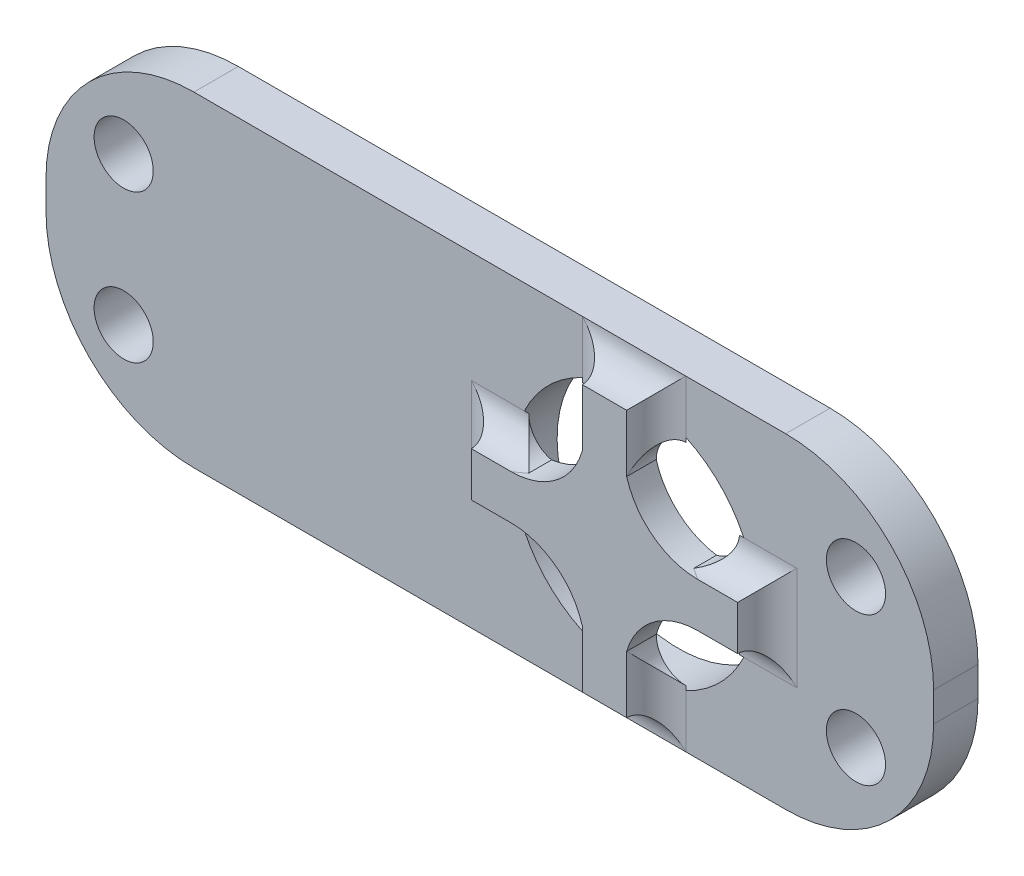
ISO-10303-21;
HEADER;
FILE_DESCRIPTION(('STEP AP214'),'2;1');
FILE_NAME('part.step','',(''),(''),'','','');
FILE_SCHEMA(('AUTOMOTIVE_DESIGN { 1 0 10303 214 1 1 1 1 }'));
ENDSEC;
DATA;
#1=APPLICATION_CONTEXT('core data for automotive mechanical design processes');
#2=APPLICATION_PROTOCOL_DEFINITION('international standard','automotive_design',2000,#1);
#3=PRODUCT_CONTEXT('',#1,'mechanical');
#4=PRODUCT('Part','Part','',(#3));
#5=PRODUCT_RELATED_PRODUCT_CATEGORY('part','',(#4));
#6=PRODUCT_DEFINITION_FORMATION('','',#4);
#7=PRODUCT_DEFINITION_CONTEXT('part definition',#1,'design');
#8=PRODUCT_DEFINITION('design','',#6,#7);
#9=PRODUCT_DEFINITION_SHAPE('','',#8);
#10=(LENGTH_UNIT() NAMED_UNIT(*) SI_UNIT(.MILLI.,.METRE.));
#11=(NAMED_UNIT(*) PLANE_ANGLE_UNIT() SI_UNIT($,.RADIAN.));
#12=(NAMED_UNIT(*) SI_UNIT($,.STERADIAN.) SOLID_ANGLE_UNIT());
#13=UNCERTAINTY_MEASURE_WITH_UNIT(LENGTH_MEASURE(1.E-05),#10,'distance_accuracy_value','');
#14=(GEOMETRIC_REPRESENTATION_CONTEXT(3) GLOBAL_UNCERTAINTY_ASSIGNED_CONTEXT((#13)) GLOBAL_UNIT_ASSIGNED_CONTEXT((#10,
#11,#12)) REPRESENTATION_CONTEXT('',''));
#15=CARTESIAN_POINT('',(0.,0.,0.));
#16=DIRECTION('',(0.,0.,1.));
#17=DIRECTION('',(1.,0.,0.));
#18=AXIS2_PLACEMENT_3D('',#15,#16,#17);
#19=CARTESIAN_POINT('',(13.2499999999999,35.1176166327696,3.));
#20=DIRECTION('',(0.,0.,-1.));
#21=DIRECTION('',(-1.,0.,0.));
#22=AXIS2_PLACEMENT_3D('',#19,#20,#21);
#23=CYLINDRICAL_SURFACE('',#22,2.);
#24=CARTESIAN_POINT('',(13.2499999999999,35.1176166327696,3.));
#25=DIRECTION('',(0.,0.,-1.));
#26=DIRECTION('',(-1.,0.,0.));
#27=AXIS2_PLACEMENT_3D('',#24,#25,#26);
#28=CIRCLE('',#27,2.);
#29=CARTESIAN_POINT('',(13.2499999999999,37.1176166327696,3.));
#30=VERTEX_POINT('',#29);
#31=CARTESIAN_POINT('',(11.2499999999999,35.1176166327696,3.));
#32=VERTEX_POINT('',#31);
#33=EDGE_CURVE('E510',#30,#32,#28,.F.);
#34=ORIENTED_EDGE('',*,*,#33,.F.);
#35=CARTESIAN_POINT('',(13.2499999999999,35.1176166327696,5.));
#36=DIRECTION('',(0.,-0.707106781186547,-0.707106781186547));
#37=DIRECTION('',(0.,-0.707106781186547,0.707106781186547));
#38=AXIS2_PLACEMENT_3D('',#35,#36,#37);
#39=ELLIPSE('',#38,2.82842712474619,2.);
#40=CARTESIAN_POINT('',(11.2499999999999,35.1176166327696,5.));
#41=VERTEX_POINT('',#40);
#42=EDGE_CURVE('E507',#41,#30,#39,.T.);
#43=ORIENTED_EDGE('',*,*,#42,.F.);
#44=DIRECTION('',(0.,0.,-1.));
#45=VECTOR('',#44,1.);
#46=CARTESIAN_POINT('',(11.2499999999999,35.1176166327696,5.));
#47=LINE('',#46,#45);
#48=EDGE_CURVE('E500',#32,#41,#47,.F.);
#49=ORIENTED_EDGE('',*,*,#48,.F.);
#50=EDGE_LOOP('',(#34,#43,#49));
#51=FACE_BOUND('',#50,.T.);
#52=ADVANCED_FACE('F37',(#51),#23,.F.);
#53=CARTESIAN_POINT('',(0.,0.,3.));
#54=DIRECTION('',(0.,0.,-1.));
#55=DIRECTION('',(-1.,0.,0.));
#56=AXIS2_PLACEMENT_3D('',#53,#54,#55);
#57=PLANE('',#56);
#58=DIRECTION('',(0.,1.,0.));
#59=VECTOR('',#58,1.);
#60=CARTESIAN_POINT('',(13.2499999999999,38.061637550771,3.));
#61=LINE('',#60,#59);
#62=CARTESIAN_POINT('',(13.2499999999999,37.415524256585,3.));
#63=VERTEX_POINT('',#62);
#64=EDGE_CURVE('E470',#63,#30,#61,.F.);
#65=ORIENTED_EDGE('',*,*,#64,.T.);
#66=ORIENTED_EDGE('',*,*,#33,.T.);
#67=CARTESIAN_POINT('',(16.0551031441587,36.5,3.));
#68=DIRECTION('',(0.,0.,-1.));
#69=DIRECTION('',(-1.,0.,0.));
#70=AXIS2_PLACEMENT_3D('',#67,#68,#69);
#71=CIRCLE('',#70,5.);
#72=CARTESIAN_POINT('',(15.326541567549,31.5533649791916,3.));
#73=VERTEX_POINT('',#72);
#74=EDGE_CURVE('E673',#32,#73,#71,.F.);
#75=ORIENTED_EDGE('',*,*,#74,.T.);
#76=CARTESIAN_POINT('',(14.8676166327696,33.5,3.));
#77=DIRECTION('',(0.,0.,-1.));
#78=DIRECTION('',(-1.,0.,0.));
#79=AXIS2_PLACEMENT_3D('',#76,#77,#78);
#80=CIRCLE('',#79,2.);
#81=CARTESIAN_POINT('',(16.8676166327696,33.5,3.));
#82=VERTEX_POINT('',#81);
#83=EDGE_CURVE('E451',#73,#82,#80,.F.);
#84=ORIENTED_EDGE('',*,*,#83,.T.);
#85=DIRECTION('',(-1.,0.,0.));
#86=VECTOR('',#85,1.);
#87=CARTESIAN_POINT('',(18.75,33.5,3.));
#88=LINE('',#87,#86);
#89=CARTESIAN_POINT('',(17.165524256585,33.5,3.));
#90=VERTEX_POINT('',#89);
#91=EDGE_CURVE('E417',#82,#90,#88,.F.);
#92=ORIENTED_EDGE('',*,*,#91,.T.);
#93=CARTESIAN_POINT('',(9.74999999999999,30.,3.));
#94=DIRECTION('',(0.,0.,1.));
#95=DIRECTION('',(1.,0.,0.));
#96=AXIS2_PLACEMENT_3D('',#93,#94,#95);
#97=CIRCLE('',#96,8.2);
#98=CARTESIAN_POINT('',(17.165524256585,26.5,3.));
#99=VERTEX_POINT('',#98);
#100=EDGE_CURVE('E339',#99,#90,#97,.T.);
#101=ORIENTED_EDGE('',*,*,#100,.F.);
#102=DIRECTION('',(1.,0.,0.));
#103=VECTOR('',#102,1.);
#104=CARTESIAN_POINT('',(17.8116375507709,26.5,3.));
#105=LINE('',#104,#103);
#106=CARTESIAN_POINT('',(16.8676166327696,26.5,3.));
#107=VERTEX_POINT('',#106);
#108=EDGE_CURVE('E412',#99,#107,#105,.F.);
#109=ORIENTED_EDGE('',*,*,#108,.T.);
#110=CARTESIAN_POINT('',(14.8676166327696,26.5,3.));
#111=DIRECTION('',(0.,0.,-1.));
#112=DIRECTION('',(-1.,0.,0.));
#113=AXIS2_PLACEMENT_3D('',#110,#111,#112);
#114=CIRCLE('',#113,2.);
#115=CARTESIAN_POINT('',(15.3265415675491,28.4466350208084,3.));
#116=VERTEX_POINT('',#115);
#117=EDGE_CURVE('E443',#107,#116,#114,.F.);
#118=ORIENTED_EDGE('',*,*,#117,.T.);
#119=CARTESIAN_POINT('',(16.0551031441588,23.5,3.));
#120=DIRECTION('',(0.,0.,-1.));
#121=DIRECTION('',(-1.,0.,0.));
#122=AXIS2_PLACEMENT_3D('',#119,#120,#121);
#123=CIRCLE('',#122,5.);
#124=CARTESIAN_POINT('',(11.25,24.8823833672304,3.));
#125=VERTEX_POINT('',#124);
#126=EDGE_CURVE('E681',#116,#125,#123,.F.);
#127=ORIENTED_EDGE('',*,*,#126,.T.);
#128=CARTESIAN_POINT('',(13.25,24.8823833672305,3.));
#129=DIRECTION('',(0.,0.,-1.));
#130=DIRECTION('',(-1.,0.,0.));
#131=AXIS2_PLACEMENT_3D('',#128,#129,#130);
#132=CIRCLE('',#131,2.);
#133=CARTESIAN_POINT('',(13.2500000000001,22.8823833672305,3.));
#134=VERTEX_POINT('',#133);
#135=EDGE_CURVE('E503',#125,#134,#132,.F.);
#136=ORIENTED_EDGE('',*,*,#135,.T.);
#137=DIRECTION('',(0.,1.,0.));
#138=VECTOR('',#137,1.);
#139=CARTESIAN_POINT('',(13.2500000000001,21.,3.));
#140=LINE('',#139,#138);
#141=CARTESIAN_POINT('',(13.2500000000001,22.5844757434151,3.));
#142=VERTEX_POINT('',#141);
#143=EDGE_CURVE('E468',#134,#142,#140,.F.);
#144=ORIENTED_EDGE('',*,*,#143,.T.);
#145=CARTESIAN_POINT('',(9.74999999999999,30.,3.));
#146=DIRECTION('',(0.,0.,-1.));
#147=DIRECTION('',(-1.,0.,0.));
#148=AXIS2_PLACEMENT_3D('',#145,#146,#147);
#149=CIRCLE('',#148,8.2);
#150=CARTESIAN_POINT('',(6.25000000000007,22.584475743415,3.));
#151=VERTEX_POINT('',#150);
#152=EDGE_CURVE('E296',#142,#151,#149,.T.);
#153=ORIENTED_EDGE('',*,*,#152,.T.);
#154=DIRECTION('',(0.,-1.,0.));
#155=VECTOR('',#154,1.);
#156=CARTESIAN_POINT('',(6.25000000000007,21.938362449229,3.));
#157=LINE('',#156,#155);
#158=CARTESIAN_POINT('',(6.25000000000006,22.8823833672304,3.));
#159=VERTEX_POINT('',#158);
#160=EDGE_CURVE('E463',#151,#159,#157,.F.);
#161=ORIENTED_EDGE('',*,*,#160,.T.);
#162=CARTESIAN_POINT('',(6.25000000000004,24.8823833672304,3.));
#163=DIRECTION('',(0.,0.,-1.));
#164=DIRECTION('',(-1.,0.,0.));
#165=AXIS2_PLACEMENT_3D('',#162,#163,#164);
#166=CIRCLE('',#165,2.);
#167=CARTESIAN_POINT('',(8.25000000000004,24.8823833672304,3.));
#168=VERTEX_POINT('',#167);
#169=EDGE_CURVE('E488',#159,#168,#166,.F.);
#170=ORIENTED_EDGE('',*,*,#169,.T.);
#171=CARTESIAN_POINT('',(3.44489685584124,23.5,3.));
#172=DIRECTION('',(0.,0.,-1.));
#173=DIRECTION('',(-1.,0.,0.));
#174=AXIS2_PLACEMENT_3D('',#171,#172,#173);
#175=CIRCLE('',#174,5.);
#176=CARTESIAN_POINT('',(4.17345843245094,28.4466350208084,3.));
#177=VERTEX_POINT('',#176);
#178=EDGE_CURVE('E679',#168,#177,#175,.F.);
#179=ORIENTED_EDGE('',*,*,#178,.T.);
#180=CARTESIAN_POINT('',(4.63238336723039,26.5,3.));
#181=DIRECTION('',(0.,0.,-1.));
#182=DIRECTION('',(-1.,0.,0.));
#183=AXIS2_PLACEMENT_3D('',#180,#181,#182);
#184=CIRCLE('',#183,2.);
#185=CARTESIAN_POINT('',(2.63238336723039,26.5,3.));
#186=VERTEX_POINT('',#185);
#187=EDGE_CURVE('E446',#177,#186,#184,.F.);
#188=ORIENTED_EDGE('',*,*,#187,.T.);
#189=DIRECTION('',(1.,0.,0.));
#190=VECTOR('',#189,1.);
#191=CARTESIAN_POINT('',(0.749999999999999,26.5,3.));
#192=LINE('',#191,#190);
#193=CARTESIAN_POINT('',(2.33447574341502,26.5,3.));
#194=VERTEX_POINT('',#193);
#195=EDGE_CURVE('E423',#186,#194,#192,.F.);
#196=ORIENTED_EDGE('',*,*,#195,.T.);
#197=CARTESIAN_POINT('',(2.33447574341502,33.5,3.));
#198=VERTEX_POINT('',#197);
#199=EDGE_CURVE('E344',#198,#194,#97,.T.);
#200=ORIENTED_EDGE('',*,*,#199,.F.);
#201=DIRECTION('',(-1.,0.,0.));
#202=VECTOR('',#201,1.);
#203=CARTESIAN_POINT('',(1.68836244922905,33.5,3.));
#204=LINE('',#203,#202);
#205=CARTESIAN_POINT('',(2.63238336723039,33.5,3.));
#206=VERTEX_POINT('',#205);
#207=EDGE_CURVE('E426',#198,#206,#204,.F.);
#208=ORIENTED_EDGE('',*,*,#207,.T.);
#209=CARTESIAN_POINT('',(4.63238336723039,33.5,3.));
#210=DIRECTION('',(0.,0.,-1.));
#211=DIRECTION('',(-1.,0.,0.));
#212=AXIS2_PLACEMENT_3D('',#209,#210,#211);
#213=CIRCLE('',#212,2.);
#214=CARTESIAN_POINT('',(4.17345843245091,31.5533649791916,3.));
#215=VERTEX_POINT('',#214);
#216=EDGE_CURVE('E458',#206,#215,#213,.F.);
#217=ORIENTED_EDGE('',*,*,#216,.T.);
#218=CARTESIAN_POINT('',(3.44489685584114,36.5,3.));
#219=DIRECTION('',(0.,0.,-1.));
#220=DIRECTION('',(-1.,0.,0.));
#221=AXIS2_PLACEMENT_3D('',#218,#219,#220);
#222=CIRCLE('',#221,5.);
#223=CARTESIAN_POINT('',(8.24999999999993,35.1176166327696,3.));
#224=VERTEX_POINT('',#223);
#225=EDGE_CURVE('E11',#215,#224,#222,.F.);
#226=ORIENTED_EDGE('',*,*,#225,.T.);
#227=CARTESIAN_POINT('',(6.24999999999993,35.1176166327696,3.));
#228=DIRECTION('',(0.,0.,-1.));
#229=DIRECTION('',(-1.,0.,0.));
#230=AXIS2_PLACEMENT_3D('',#227,#228,#229);
#231=CIRCLE('',#230,2.);
#232=CARTESIAN_POINT('',(6.24999999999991,37.1176166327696,3.));
#233=VERTEX_POINT('',#232);
#234=EDGE_CURVE('E491',#224,#233,#231,.F.);
#235=ORIENTED_EDGE('',*,*,#234,.T.);
#236=DIRECTION('',(0.,-1.,0.));
#237=VECTOR('',#236,1.);
#238=CARTESIAN_POINT('',(6.24999999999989,39.,3.));
#239=LINE('',#238,#237);
#240=CARTESIAN_POINT('',(6.24999999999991,37.4155242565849,3.));
#241=VERTEX_POINT('',#240);
#242=EDGE_CURVE('E461',#233,#241,#239,.F.);
#243=ORIENTED_EDGE('',*,*,#242,.T.);
#244=EDGE_CURVE('E300',#241,#63,#149,.T.);
#245=ORIENTED_EDGE('',*,*,#244,.T.);
#246=EDGE_LOOP('',(#65,#66,#75,#84,#92,#101,#109,#118,#127,#136,#144,#153,#161,#170,#179,#188,
#196,#200,#208,#217,#226,#235,#243,#245));
#247=FACE_BOUND('',#246,.T.);
#248=ADVANCED_FACE('F646',(#247),#57,.T.);
#249=CARTESIAN_POINT('',(20.,31.,3.));
#250=DIRECTION('',(0.,0.,-1.));
#251=DIRECTION('',(-1.,0.,0.));
#252=AXIS2_PLACEMENT_3D('',#249,#250,#251);
#253=PLANE('',#252);
#254=CARTESIAN_POINT('',(24.75,35.,3.));
#255=DIRECTION('',(0.,0.,1.));
#256=DIRECTION('',(1.,0.,0.));
#257=AXIS2_PLACEMENT_3D('',#254,#255,#256);
#258=CIRCLE('',#257,2.);
#259=CARTESIAN_POINT('',(26.75,35.,3.));
#260=VERTEX_POINT('',#259);
#261=EDGE_CURVE('E327',#260,#260,#258,.T.);
#262=ORIENTED_EDGE('',*,*,#261,.F.);
#263=EDGE_LOOP('',(#262));
#264=FACE_BOUND('',#263,.T.);
#265=CARTESIAN_POINT('',(24.75,25.,3.));
#266=DIRECTION('',(0.,0.,1.));
#267=DIRECTION('',(1.,0.,0.));
#268=AXIS2_PLACEMENT_3D('',#265,#266,#267);
#269=CIRCLE('',#268,2.);
#270=CARTESIAN_POINT('',(26.75,25.,3.));
#271=VERTEX_POINT('',#270);
#272=EDGE_CURVE('E333',#271,#271,#269,.T.);
#273=ORIENTED_EDGE('',*,*,#272,.F.);
#274=EDGE_LOOP('',(#273));
#275=FACE_BOUND('',#274,.T.);
#276=CARTESIAN_POINT('',(13.2499999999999,41.,3.));
#277=VERTEX_POINT('',#276);
#278=EDGE_CURVE('E471',#277,#63,#61,.F.);
#279=ORIENTED_EDGE('',*,*,#278,.T.);
#280=EDGE_CURVE('E343',#90,#63,#97,.T.);
#281=ORIENTED_EDGE('',*,*,#280,.F.);
#282=CARTESIAN_POINT('',(20.75,33.5,3.));
#283=VERTEX_POINT('',#282);
#284=EDGE_CURVE('E416',#90,#283,#88,.F.);
#285=ORIENTED_EDGE('',*,*,#284,.T.);
#286=DIRECTION('',(0.,1.,0.));
#287=VECTOR('',#286,1.);
#288=CARTESIAN_POINT('',(20.75,28.5,3.));
#289=LINE('',#288,#287);
#290=CARTESIAN_POINT('',(20.75,26.5,3.));
#291=VERTEX_POINT('',#290);
#292=EDGE_CURVE('E410',#283,#291,#289,.F.);
#293=ORIENTED_EDGE('',*,*,#292,.T.);
#294=EDGE_CURVE('E413',#291,#99,#105,.F.);
#295=ORIENTED_EDGE('',*,*,#294,.T.);
#296=EDGE_CURVE('E297',#99,#142,#149,.T.);
#297=ORIENTED_EDGE('',*,*,#296,.T.);
#298=CARTESIAN_POINT('',(13.2500000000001,19.,3.));
#299=VERTEX_POINT('',#298);
#300=EDGE_CURVE('E467',#142,#299,#140,.F.);
#301=ORIENTED_EDGE('',*,*,#300,.T.);
#302=DIRECTION('',(1.,0.,0.));
#303=VECTOR('',#302,1.);
#304=CARTESIAN_POINT('',(-19.9999999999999,19.,3.));
#305=LINE('',#304,#303);
#306=CARTESIAN_POINT('',(19.9999999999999,19.,3.));
#307=VERTEX_POINT('',#306);
#308=EDGE_CURVE('E363',#299,#307,#305,.T.);
#309=ORIENTED_EDGE('',*,*,#308,.T.);
#310=CARTESIAN_POINT('',(20.,29.,3.));
#311=DIRECTION('',(0.,0.,1.));
#312=DIRECTION('',(1.,0.,0.));
#313=AXIS2_PLACEMENT_3D('',#310,#311,#312);
#314=CIRCLE('',#313,10.);
#315=CARTESIAN_POINT('',(30.,29.,3.));
#316=VERTEX_POINT('',#315);
#317=EDGE_CURVE('E367',#307,#316,#314,.T.);
#318=ORIENTED_EDGE('',*,*,#317,.T.);
#319=DIRECTION('',(0.,1.,0.));
#320=VECTOR('',#319,1.);
#321=CARTESIAN_POINT('',(30.,30.9999999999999,3.));
#322=LINE('',#321,#320);
#323=CARTESIAN_POINT('',(30.,30.9999999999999,3.));
#324=VERTEX_POINT('',#323);
#325=EDGE_CURVE('E369',#316,#324,#322,.T.);
#326=ORIENTED_EDGE('',*,*,#325,.T.);
#327=CARTESIAN_POINT('',(20.,31.,3.));
#328=DIRECTION('',(0.,0.,1.));
#329=DIRECTION('',(-1.,0.,0.));
#330=AXIS2_PLACEMENT_3D('',#327,#328,#329);
#331=CIRCLE('',#330,10.);
#332=CARTESIAN_POINT('',(19.9999999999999,41.,3.));
#333=VERTEX_POINT('',#332);
#334=EDGE_CURVE('E348',#324,#333,#331,.T.);
#335=ORIENTED_EDGE('',*,*,#334,.T.);
#336=DIRECTION('',(-1.,0.,0.));
#337=VECTOR('',#336,1.);
#338=CARTESIAN_POINT('',(-19.9999999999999,41.,3.));
#339=LINE('',#338,#337);
#340=EDGE_CURVE('E353',#333,#277,#339,.T.);
#341=ORIENTED_EDGE('',*,*,#340,.T.);
#342=EDGE_LOOP('',(#279,#281,#285,#293,#295,#297,#301,#309,#318,#326,#335,#341));
#343=FACE_BOUND('',#342,.T.);
#344=ADVANCED_FACE('F626',(#264,#275,#343),#253,.F.);
#345=CARTESIAN_POINT('',(6.25000000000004,24.8823833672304,3.));
#346=DIRECTION('',(0.,0.,-1.));
#347=DIRECTION('',(-1.,0.,0.));
#348=AXIS2_PLACEMENT_3D('',#345,#346,#347);
#349=CYLINDRICAL_SURFACE('',#348,2.);
#350=ORIENTED_EDGE('',*,*,#169,.F.);
#351=CARTESIAN_POINT('',(6.25000000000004,24.8823833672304,5.));
#352=DIRECTION('',(0.,0.707106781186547,-0.707106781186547));
#353=DIRECTION('',(0.,0.707106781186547,0.707106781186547));
#354=AXIS2_PLACEMENT_3D('',#351,#352,#353);
#355=ELLIPSE('',#354,2.82842712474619,2.);
#356=CARTESIAN_POINT('',(8.25000000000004,24.8823833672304,5.));
#357=VERTEX_POINT('',#356);
#358=EDGE_CURVE('E485',#357,#159,#355,.T.);
#359=ORIENTED_EDGE('',*,*,#358,.F.);
#360=DIRECTION('',(0.,0.,-1.));
#361=VECTOR('',#360,1.);
#362=CARTESIAN_POINT('',(8.25000000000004,24.8823833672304,5.));
#363=LINE('',#362,#361);
#364=EDGE_CURVE('E474',#168,#357,#363,.F.);
#365=ORIENTED_EDGE('',*,*,#364,.F.);
#366=EDGE_LOOP('',(#350,#359,#365));
#367=FACE_BOUND('',#366,.T.);
#368=ADVANCED_FACE('F624',(#367),#349,.F.);
#369=CARTESIAN_POINT('',(-24.75,25.,3.));
#370=DIRECTION('',(0.,0.,1.));
#371=DIRECTION('',(1.,0.,0.));
#372=AXIS2_PLACEMENT_3D('',#369,#370,#371);
#373=CIRCLE('',#372,2.);
#374=CARTESIAN_POINT('',(-22.75,25.,3.));
#375=VERTEX_POINT('',#374);
#376=EDGE_CURVE('E321',#375,#375,#373,.T.);
#377=ORIENTED_EDGE('',*,*,#376,.F.);
#378=EDGE_LOOP('',(#377));
#379=FACE_BOUND('',#378,.T.);
#380=CARTESIAN_POINT('',(-24.75,35.,3.));
#381=DIRECTION('',(0.,0.,1.));
#382=DIRECTION('',(1.,0.,0.));
#383=AXIS2_PLACEMENT_3D('',#380,#381,#382);
#384=CIRCLE('',#383,2.);
#385=CARTESIAN_POINT('',(-22.75,35.,3.));
#386=VERTEX_POINT('',#385);
#387=EDGE_CURVE('E315',#386,#386,#384,.T.);
#388=ORIENTED_EDGE('',*,*,#387,.F.);
#389=EDGE_LOOP('',(#388));
#390=FACE_BOUND('',#389,.T.);
#391=CARTESIAN_POINT('',(-1.25,33.5,3.));
#392=VERTEX_POINT('',#391);
#393=EDGE_CURVE('E427',#392,#198,#204,.F.);
#394=ORIENTED_EDGE('',*,*,#393,.T.);
#395=EDGE_CURVE('E301',#198,#241,#149,.T.);
#396=ORIENTED_EDGE('',*,*,#395,.T.);
#397=CARTESIAN_POINT('',(6.24999999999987,41.,3.));
#398=VERTEX_POINT('',#397);
#399=EDGE_CURVE('E460',#241,#398,#239,.F.);
#400=ORIENTED_EDGE('',*,*,#399,.T.);
#401=CARTESIAN_POINT('',(-19.9999999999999,41.,3.));
#402=VERTEX_POINT('',#401);
#403=EDGE_CURVE('E351',#398,#402,#339,.T.);
#404=ORIENTED_EDGE('',*,*,#403,.T.);
#405=CARTESIAN_POINT('',(-20.,31.,3.));
#406=DIRECTION('',(0.,0.,1.));
#407=DIRECTION('',(1.,0.,0.));
#408=AXIS2_PLACEMENT_3D('',#405,#406,#407);
#409=CIRCLE('',#408,10.);
#410=CARTESIAN_POINT('',(-30.,30.9999999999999,3.));
#411=VERTEX_POINT('',#410);
#412=EDGE_CURVE('E356',#402,#411,#409,.T.);
#413=ORIENTED_EDGE('',*,*,#412,.T.);
#414=DIRECTION('',(0.,-1.,0.));
#415=VECTOR('',#414,1.);
#416=CARTESIAN_POINT('',(-30.,30.9999999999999,3.));
#417=LINE('',#416,#415);
#418=CARTESIAN_POINT('',(-30.,29.0000000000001,3.));
#419=VERTEX_POINT('',#418);
#420=EDGE_CURVE('E359',#411,#419,#417,.T.);
#421=ORIENTED_EDGE('',*,*,#420,.T.);
#422=CARTESIAN_POINT('',(-20.,29.,3.));
#423=DIRECTION('',(0.,0.,1.));
#424=DIRECTION('',(1.,0.,0.));
#425=AXIS2_PLACEMENT_3D('',#422,#423,#424);
#426=CIRCLE('',#425,10.);
#427=CARTESIAN_POINT('',(-19.9999999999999,19.,3.));
#428=VERTEX_POINT('',#427);
#429=EDGE_CURVE('E361',#419,#428,#426,.T.);
#430=ORIENTED_EDGE('',*,*,#429,.T.);
#431=CARTESIAN_POINT('',(6.2500000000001,19.,3.));
#432=VERTEX_POINT('',#431);
#433=EDGE_CURVE('E364',#428,#432,#305,.T.);
#434=ORIENTED_EDGE('',*,*,#433,.T.);
#435=EDGE_CURVE('E464',#432,#151,#157,.F.);
#436=ORIENTED_EDGE('',*,*,#435,.T.);
#437=EDGE_CURVE('E347',#194,#151,#97,.T.);
#438=ORIENTED_EDGE('',*,*,#437,.F.);
#439=CARTESIAN_POINT('',(-1.25,26.5,3.));
#440=VERTEX_POINT('',#439);
#441=EDGE_CURVE('E422',#194,#440,#192,.F.);
#442=ORIENTED_EDGE('',*,*,#441,.T.);
#443=DIRECTION('',(0.,-1.,0.));
#444=VECTOR('',#443,1.);
#445=CARTESIAN_POINT('',(-1.25,31.5,3.));
#446=LINE('',#445,#444);
#447=EDGE_CURVE('E420',#440,#392,#446,.F.);
#448=ORIENTED_EDGE('',*,*,#447,.T.);
#449=EDGE_LOOP('',(#394,#396,#400,#404,#413,#421,#430,#434,#436,#438,#442,#448));
#450=FACE_BOUND('',#449,.T.);
#451=ADVANCED_FACE('F620',(#379,#390,#450),#253,.F.);
#452=CARTESIAN_POINT('',(4.63238336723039,33.5,3.));
#453=DIRECTION('',(0.,0.,-1.));
#454=DIRECTION('',(-1.,0.,0.));
#455=AXIS2_PLACEMENT_3D('',#452,#453,#454);
#456=CYLINDRICAL_SURFACE('',#455,2.);
#457=CARTESIAN_POINT('',(4.63238336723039,33.5,5.));
#458=DIRECTION('',(0.707106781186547,0.,-0.707106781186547));
#459=DIRECTION('',(0.707106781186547,0.,0.707106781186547));
#460=AXIS2_PLACEMENT_3D('',#457,#458,#459);
#461=ELLIPSE('',#460,2.82842712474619,2.);
#462=CARTESIAN_POINT('',(4.17345843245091,31.5533649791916,4.54107506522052));
#463=VERTEX_POINT('',#462);
#464=EDGE_CURVE('E456',#463,#206,#461,.T.);
#465=ORIENTED_EDGE('',*,*,#464,.F.);
#466=DIRECTION('',(0.,0.,-1.));
#467=VECTOR('',#466,1.);
#468=CARTESIAN_POINT('',(4.17345843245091,31.5533649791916,3.77053753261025));
#469=LINE('',#468,#467);
#470=EDGE_CURVE('E53',#463,#215,#469,.T.);
#471=ORIENTED_EDGE('',*,*,#470,.T.);
#472=ORIENTED_EDGE('',*,*,#216,.F.);
#473=EDGE_LOOP('',(#465,#471,#472));
#474=FACE_BOUND('',#473,.T.);
#475=ADVANCED_FACE('F623',(#474),#456,.F.);
#476=CARTESIAN_POINT('',(14.8676166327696,26.5,3.));
#477=DIRECTION('',(0.,0.,-1.));
#478=DIRECTION('',(-1.,0.,0.));
#479=AXIS2_PLACEMENT_3D('',#476,#477,#478);
#480=CYLINDRICAL_SURFACE('',#479,2.);
#481=CARTESIAN_POINT('',(14.8676166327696,26.5,5.));
#482=DIRECTION('',(-0.707106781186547,0.,-0.707106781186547));
#483=DIRECTION('',(-0.707106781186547,0.,0.707106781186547));
#484=AXIS2_PLACEMENT_3D('',#481,#482,#483);
#485=ELLIPSE('',#484,2.82842712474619,2.);
#486=CARTESIAN_POINT('',(15.3265415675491,28.4466350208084,4.54107506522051));
#487=VERTEX_POINT('',#486);
#488=EDGE_CURVE('E430',#487,#107,#485,.T.);
#489=ORIENTED_EDGE('',*,*,#488,.F.);
#490=DIRECTION('',(0.,0.,-1.));
#491=VECTOR('',#490,1.);
#492=CARTESIAN_POINT('',(15.3265415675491,28.4466350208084,3.77053753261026));
#493=LINE('',#492,#491);
#494=EDGE_CURVE('E521',#487,#116,#493,.T.);
#495=ORIENTED_EDGE('',*,*,#494,.T.);
#496=ORIENTED_EDGE('',*,*,#117,.F.);
#497=EDGE_LOOP('',(#489,#495,#496));
#498=FACE_BOUND('',#497,.T.);
#499=ADVANCED_FACE('F618',(#498),#480,.F.);
#500=CARTESIAN_POINT('',(20.,31.,0.));
#501=DIRECTION('',(0.,0.,-1.));
#502=DIRECTION('',(-1.,0.,0.));
#503=AXIS2_PLACEMENT_3D('',#500,#501,#502);
#504=PLANE('',#503);
#505=CARTESIAN_POINT('',(-24.75,25.,0.));
#506=DIRECTION('',(0.,0.,1.));
#507=DIRECTION('',(1.,0.,0.));
#508=AXIS2_PLACEMENT_3D('',#505,#506,#507);
#509=CIRCLE('',#508,2.);
#510=CARTESIAN_POINT('',(-22.75,25.,0.));
#511=VERTEX_POINT('',#510);
#512=EDGE_CURVE('E318',#511,#511,#509,.T.);
#513=ORIENTED_EDGE('',*,*,#512,.T.);
#514=EDGE_LOOP('',(#513));
#515=FACE_BOUND('',#514,.T.);
#516=CARTESIAN_POINT('',(24.75,25.,0.));
#517=DIRECTION('',(0.,0.,1.));
#518=DIRECTION('',(1.,0.,0.));
#519=AXIS2_PLACEMENT_3D('',#516,#517,#518);
#520=CIRCLE('',#519,2.);
#521=CARTESIAN_POINT('',(26.75,25.,0.));
#522=VERTEX_POINT('',#521);
#523=EDGE_CURVE('E330',#522,#522,#520,.T.);
#524=ORIENTED_EDGE('',*,*,#523,.T.);
#525=EDGE_LOOP('',(#524));
#526=FACE_BOUND('',#525,.T.);
#527=CARTESIAN_POINT('',(20.,31.,0.));
#528=DIRECTION('',(0.,0.,1.));
#529=DIRECTION('',(-1.,0.,0.));
#530=AXIS2_PLACEMENT_3D('',#527,#528,#529);
#531=CIRCLE('',#530,10.);
#532=CARTESIAN_POINT('',(30.,30.9999999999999,0.));
#533=VERTEX_POINT('',#532);
#534=CARTESIAN_POINT('',(19.9999999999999,41.,0.));
#535=VERTEX_POINT('',#534);
#536=EDGE_CURVE('E342',#533,#535,#531,.T.);
#537=ORIENTED_EDGE('',*,*,#536,.F.);
#538=DIRECTION('',(0.,1.,0.));
#539=VECTOR('',#538,1.);
#540=CARTESIAN_POINT('',(30.,30.9999999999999,0.));
#541=LINE('',#540,#539);
#542=CARTESIAN_POINT('',(30.,29.,0.));
#543=VERTEX_POINT('',#542);
#544=EDGE_CURVE('E352',#543,#533,#541,.T.);
#545=ORIENTED_EDGE('',*,*,#544,.F.);
#546=CARTESIAN_POINT('',(20.,29.,0.));
#547=DIRECTION('',(0.,0.,1.));
#548=DIRECTION('',(1.,0.,0.));
#549=AXIS2_PLACEMENT_3D('',#546,#547,#548);
#550=CIRCLE('',#549,10.);
#551=CARTESIAN_POINT('',(19.9999999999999,19.,0.));
#552=VERTEX_POINT('',#551);
#553=EDGE_CURVE('E384',#552,#543,#550,.T.);
#554=ORIENTED_EDGE('',*,*,#553,.F.);
#555=DIRECTION('',(1.,0.,0.));
#556=VECTOR('',#555,1.);
#557=CARTESIAN_POINT('',(-19.9999999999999,19.,0.));
#558=LINE('',#557,#556);
#559=CARTESIAN_POINT('',(-19.9999999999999,19.,0.));
#560=VERTEX_POINT('',#559);
#561=EDGE_CURVE('E382',#560,#552,#558,.T.);
#562=ORIENTED_EDGE('',*,*,#561,.F.);
#563=CARTESIAN_POINT('',(-20.,29.,0.));
#564=DIRECTION('',(0.,0.,1.));
#565=DIRECTION('',(1.,0.,0.));
#566=AXIS2_PLACEMENT_3D('',#563,#564,#565);
#567=CIRCLE('',#566,10.);
#568=CARTESIAN_POINT('',(-30.,29.0000000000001,0.));
#569=VERTEX_POINT('',#568);
#570=EDGE_CURVE('E380',#569,#560,#567,.T.);
#571=ORIENTED_EDGE('',*,*,#570,.F.);
#572=DIRECTION('',(0.,-1.,0.));
#573=VECTOR('',#572,1.);
#574=CARTESIAN_POINT('',(-30.,30.9999999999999,0.));
#575=LINE('',#574,#573);
#576=CARTESIAN_POINT('',(-30.,30.9999999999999,0.));
#577=VERTEX_POINT('',#576);
#578=EDGE_CURVE('E378',#577,#569,#575,.T.);
#579=ORIENTED_EDGE('',*,*,#578,.F.);
#580=CARTESIAN_POINT('',(-20.,31.,0.));
#581=DIRECTION('',(0.,0.,1.));
#582=DIRECTION('',(1.,0.,0.));
#583=AXIS2_PLACEMENT_3D('',#580,#581,#582);
#584=CIRCLE('',#583,10.);
#585=CARTESIAN_POINT('',(-19.9999999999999,41.,0.));
#586=VERTEX_POINT('',#585);
#587=EDGE_CURVE('E376',#586,#577,#584,.T.);
#588=ORIENTED_EDGE('',*,*,#587,.F.);
#589=DIRECTION('',(-1.,0.,0.));
#590=VECTOR('',#589,1.);
#591=CARTESIAN_POINT('',(-19.9999999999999,41.,0.));
#592=LINE('',#591,#590);
#593=EDGE_CURVE('E374',#535,#586,#592,.T.);
#594=ORIENTED_EDGE('',*,*,#593,.F.);
#595=EDGE_LOOP('',(#537,#545,#554,#562,#571,#579,#588,#594));
#596=FACE_BOUND('',#595,.T.);
#597=CARTESIAN_POINT('',(9.74999999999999,30.,0.));
#598=DIRECTION('',(0.,0.,1.));
#599=DIRECTION('',(1.,0.,0.));
#600=AXIS2_PLACEMENT_3D('',#597,#598,#599);
#601=CIRCLE('',#600,8.2);
#602=CARTESIAN_POINT('',(17.95,30.,0.));
#603=VERTEX_POINT('',#602);
#604=EDGE_CURVE('E336',#603,#603,#601,.T.);
#605=ORIENTED_EDGE('',*,*,#604,.T.);
#606=EDGE_LOOP('',(#605));
#607=FACE_BOUND('',#606,.T.);
#608=CARTESIAN_POINT('',(24.75,35.,0.));
#609=DIRECTION('',(0.,0.,1.));
#610=DIRECTION('',(1.,0.,0.));
#611=AXIS2_PLACEMENT_3D('',#608,#609,#610);
#612=CIRCLE('',#611,2.);
#613=CARTESIAN_POINT('',(26.75,35.,0.));
#614=VERTEX_POINT('',#613);
#615=EDGE_CURVE('E324',#614,#614,#612,.T.);
#616=ORIENTED_EDGE('',*,*,#615,.T.);
#617=EDGE_LOOP('',(#616));
#618=FACE_BOUND('',#617,.T.);
#619=CARTESIAN_POINT('',(-24.75,35.,0.));
#620=DIRECTION('',(0.,0.,1.));
#621=DIRECTION('',(1.,0.,0.));
#622=AXIS2_PLACEMENT_3D('',#619,#620,#621);
#623=CIRCLE('',#622,2.);
#624=CARTESIAN_POINT('',(-22.75,35.,0.));
#625=VERTEX_POINT('',#624);
#626=EDGE_CURVE('E314',#625,#625,#623,.T.);
#627=ORIENTED_EDGE('',*,*,#626,.T.);
#628=EDGE_LOOP('',(#627));
#629=FACE_BOUND('',#628,.T.);
#630=ADVANCED_FACE('F586',(#515,#526,#596,#607,#618,#629),#504,.T.);
#631=CARTESIAN_POINT('',(20.,31.,3.));
#632=DIRECTION('',(0.,0.,-1.));
#633=DIRECTION('',(-1.,0.,0.));
#634=AXIS2_PLACEMENT_3D('',#631,#632,#633);
#635=CYLINDRICAL_SURFACE('',#634,10.);
#636=ORIENTED_EDGE('',*,*,#536,.T.);
#637=DIRECTION('',(0.,0.,-1.));
#638=VECTOR('',#637,1.);
#639=CARTESIAN_POINT('',(19.9999999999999,41.,3.));
#640=LINE('',#639,#638);
#641=EDGE_CURVE('E407',#333,#535,#640,.T.);
#642=ORIENTED_EDGE('',*,*,#641,.F.);
#643=ORIENTED_EDGE('',*,*,#334,.F.);
#644=DIRECTION('',(0.,0.,-1.));
#645=VECTOR('',#644,1.);
#646=CARTESIAN_POINT('',(30.,30.9999999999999,3.));
#647=LINE('',#646,#645);
#648=EDGE_CURVE('E371',#324,#533,#647,.T.);
#649=ORIENTED_EDGE('',*,*,#648,.T.);
#650=EDGE_LOOP('',(#636,#642,#643,#649));
#651=FACE_BOUND('',#650,.T.);
#652=ADVANCED_FACE('F582',(#651),#635,.T.);
#653=CARTESIAN_POINT('',(-19.9999999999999,41.,3.));
#654=DIRECTION('',(0.,-1.,0.));
#655=DIRECTION('',(0.,0.,-1.));
#656=AXIS2_PLACEMENT_3D('',#653,#654,#655);
#657=PLANE('',#656);
#658=ORIENTED_EDGE('',*,*,#593,.T.);
#659=DIRECTION('',(0.,0.,-1.));
#660=VECTOR('',#659,1.);
#661=CARTESIAN_POINT('',(-19.9999999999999,41.,3.));
#662=LINE('',#661,#660);
#663=EDGE_CURVE('E404',#402,#586,#662,.T.);
#664=ORIENTED_EDGE('',*,*,#663,.F.);
#665=ORIENTED_EDGE('',*,*,#403,.F.);
#666=EDGE_CURVE('E357',#277,#398,#339,.T.);
#667=ORIENTED_EDGE('',*,*,#666,.F.);
#668=ORIENTED_EDGE('',*,*,#340,.F.);
#669=ORIENTED_EDGE('',*,*,#641,.T.);
#670=EDGE_LOOP('',(#658,#664,#665,#667,#668,#669));
#671=FACE_BOUND('',#670,.T.);
#672=ADVANCED_FACE('F585',(#671),#657,.F.);
#673=CARTESIAN_POINT('',(-20.,31.,3.));
#674=DIRECTION('',(0.,0.,-1.));
#675=DIRECTION('',(-1.,0.,0.));
#676=AXIS2_PLACEMENT_3D('',#673,#674,#675);
#677=CYLINDRICAL_SURFACE('',#676,10.);
#678=ORIENTED_EDGE('',*,*,#587,.T.);
#679=DIRECTION('',(0.,0.,-1.));
#680=VECTOR('',#679,1.);
#681=CARTESIAN_POINT('',(-30.,30.9999999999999,3.));
#682=LINE('',#681,#680);
#683=EDGE_CURVE('E401',#411,#577,#682,.T.);
#684=ORIENTED_EDGE('',*,*,#683,.F.);
#685=ORIENTED_EDGE('',*,*,#412,.F.);
#686=ORIENTED_EDGE('',*,*,#663,.T.);
#687=EDGE_LOOP('',(#678,#684,#685,#686));
#688=FACE_BOUND('',#687,.T.);
#689=ADVANCED_FACE('F590',(#688),#677,.T.);
#690=CARTESIAN_POINT('',(-30.,30.9999999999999,3.));
#691=DIRECTION('',(1.,0.,0.));
#692=DIRECTION('',(0.,0.,-1.));
#693=AXIS2_PLACEMENT_3D('',#690,#691,#692);
#694=PLANE('',#693);
#695=ORIENTED_EDGE('',*,*,#578,.T.);
#696=DIRECTION('',(0.,0.,-1.));
#697=VECTOR('',#696,1.);
#698=CARTESIAN_POINT('',(-30.,29.0000000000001,3.));
#699=LINE('',#698,#697);
#700=EDGE_CURVE('E398',#419,#569,#699,.T.);
#701=ORIENTED_EDGE('',*,*,#700,.F.);
#702=ORIENTED_EDGE('',*,*,#420,.F.);
#703=ORIENTED_EDGE('',*,*,#683,.T.);
#704=EDGE_LOOP('',(#695,#701,#702,#703));
#705=FACE_BOUND('',#704,.T.);
#706=ADVANCED_FACE('F594',(#705),#694,.F.);
#707=CARTESIAN_POINT('',(-20.,29.,3.));
#708=DIRECTION('',(0.,0.,-1.));
#709=DIRECTION('',(-1.,0.,0.));
#710=AXIS2_PLACEMENT_3D('',#707,#708,#709);
#711=CYLINDRICAL_SURFACE('',#710,10.);
#712=ORIENTED_EDGE('',*,*,#570,.T.);
#713=DIRECTION('',(0.,0.,-1.));
#714=VECTOR('',#713,1.);
#715=CARTESIAN_POINT('',(-19.9999999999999,19.,3.));
#716=LINE('',#715,#714);
#717=EDGE_CURVE('E395',#428,#560,#716,.T.);
#718=ORIENTED_EDGE('',*,*,#717,.F.);
#719=ORIENTED_EDGE('',*,*,#429,.F.);
#720=ORIENTED_EDGE('',*,*,#700,.T.);
#721=EDGE_LOOP('',(#712,#718,#719,#720));
#722=FACE_BOUND('',#721,.T.);
#723=ADVANCED_FACE('F598',(#722),#711,.T.);
#724=CARTESIAN_POINT('',(-19.9999999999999,19.,3.));
#725=DIRECTION('',(0.,1.,0.));
#726=DIRECTION('',(0.,0.,1.));
#727=AXIS2_PLACEMENT_3D('',#724,#725,#726);
#728=PLANE('',#727);
#729=ORIENTED_EDGE('',*,*,#561,.T.);
#730=DIRECTION('',(0.,0.,-1.));
#731=VECTOR('',#730,1.);
#732=CARTESIAN_POINT('',(19.9999999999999,19.,3.));
#733=LINE('',#732,#731);
#734=EDGE_CURVE('E392',#307,#552,#733,.T.);
#735=ORIENTED_EDGE('',*,*,#734,.F.);
#736=ORIENTED_EDGE('',*,*,#308,.F.);
#737=EDGE_CURVE('E279',#432,#299,#305,.T.);
#738=ORIENTED_EDGE('',*,*,#737,.F.);
#739=ORIENTED_EDGE('',*,*,#433,.F.);
#740=ORIENTED_EDGE('',*,*,#717,.T.);
#741=EDGE_LOOP('',(#729,#735,#736,#738,#739,#740));
#742=FACE_BOUND('',#741,.T.);
#743=ADVANCED_FACE('F602',(#742),#728,.F.);
#744=CARTESIAN_POINT('',(20.,29.,3.));
#745=DIRECTION('',(0.,0.,-1.));
#746=DIRECTION('',(-1.,0.,0.));
#747=AXIS2_PLACEMENT_3D('',#744,#745,#746);
#748=CYLINDRICAL_SURFACE('',#747,10.);
#749=ORIENTED_EDGE('',*,*,#553,.T.);
#750=DIRECTION('',(0.,0.,-1.));
#751=VECTOR('',#750,1.);
#752=CARTESIAN_POINT('',(30.,29.,3.));
#753=LINE('',#752,#751);
#754=EDGE_CURVE('E389',#316,#543,#753,.T.);
#755=ORIENTED_EDGE('',*,*,#754,.F.);
#756=ORIENTED_EDGE('',*,*,#317,.F.);
#757=ORIENTED_EDGE('',*,*,#734,.T.);
#758=EDGE_LOOP('',(#749,#755,#756,#757));
#759=FACE_BOUND('',#758,.T.);
#760=ADVANCED_FACE('F606',(#759),#748,.T.);
#761=CARTESIAN_POINT('',(30.,30.9999999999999,3.));
#762=DIRECTION('',(-1.,0.,0.));
#763=DIRECTION('',(0.,0.,1.));
#764=AXIS2_PLACEMENT_3D('',#761,#762,#763);
#765=PLANE('',#764);
#766=ORIENTED_EDGE('',*,*,#544,.T.);
#767=ORIENTED_EDGE('',*,*,#648,.F.);
#768=ORIENTED_EDGE('',*,*,#325,.F.);
#769=ORIENTED_EDGE('',*,*,#754,.T.);
#770=EDGE_LOOP('',(#766,#767,#768,#769));
#771=FACE_BOUND('',#770,.T.);
#772=ADVANCED_FACE('F610',(#771),#765,.F.);
#773=CARTESIAN_POINT('',(9.74999999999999,30.,3.));
#774=DIRECTION('',(0.,0.,-1.));
#775=DIRECTION('',(-1.,0.,0.));
#776=AXIS2_PLACEMENT_3D('',#773,#774,#775);
#777=CYLINDRICAL_SURFACE('',#776,8.2);
#778=ORIENTED_EDGE('',*,*,#296,.F.);
#779=ORIENTED_EDGE('',*,*,#100,.T.);
#780=ORIENTED_EDGE('',*,*,#280,.T.);
#781=ORIENTED_EDGE('',*,*,#244,.F.);
#782=ORIENTED_EDGE('',*,*,#395,.F.);
#783=ORIENTED_EDGE('',*,*,#199,.T.);
#784=ORIENTED_EDGE('',*,*,#437,.T.);
#785=ORIENTED_EDGE('',*,*,#152,.F.);
#786=EDGE_LOOP('',(#778,#779,#780,#781,#782,#783,#784,#785));
#787=FACE_BOUND('',#786,.T.);
#788=ORIENTED_EDGE('',*,*,#604,.F.);
#789=EDGE_LOOP('',(#788));
#790=FACE_BOUND('',#789,.T.);
#791=ADVANCED_FACE('F614',(#787,#790),#777,.F.);
#792=CARTESIAN_POINT('',(24.75,25.,3.));
#793=DIRECTION('',(0.,0.,-1.));
#794=DIRECTION('',(-1.,0.,0.));
#795=AXIS2_PLACEMENT_3D('',#792,#793,#794);
#796=CYLINDRICAL_SURFACE('',#795,2.);
#797=ORIENTED_EDGE('',*,*,#272,.T.);
#798=EDGE_LOOP('',(#797));
#799=FACE_BOUND('',#798,.T.);
#800=ORIENTED_EDGE('',*,*,#523,.F.);
#801=EDGE_LOOP('',(#800));
#802=FACE_BOUND('',#801,.T.);
#803=ADVANCED_FACE('F629',(#799,#802),#796,.F.);
#804=CARTESIAN_POINT('',(24.75,35.,3.));
#805=DIRECTION('',(0.,0.,-1.));
#806=DIRECTION('',(-1.,0.,0.));
#807=AXIS2_PLACEMENT_3D('',#804,#805,#806);
#808=CYLINDRICAL_SURFACE('',#807,2.);
#809=ORIENTED_EDGE('',*,*,#261,.T.);
#810=EDGE_LOOP('',(#809));
#811=FACE_BOUND('',#810,.T.);
#812=ORIENTED_EDGE('',*,*,#615,.F.);
#813=EDGE_LOOP('',(#812));
#814=FACE_BOUND('',#813,.T.);
#815=ADVANCED_FACE('F633',(#811,#814),#808,.F.);
#816=CARTESIAN_POINT('',(-24.75,25.,3.));
#817=DIRECTION('',(0.,0.,-1.));
#818=DIRECTION('',(-1.,0.,0.));
#819=AXIS2_PLACEMENT_3D('',#816,#817,#818);
#820=CYLINDRICAL_SURFACE('',#819,2.);
#821=ORIENTED_EDGE('',*,*,#376,.T.);
#822=EDGE_LOOP('',(#821));
#823=FACE_BOUND('',#822,.T.);
#824=ORIENTED_EDGE('',*,*,#512,.F.);
#825=EDGE_LOOP('',(#824));
#826=FACE_BOUND('',#825,.T.);
#827=ADVANCED_FACE('F637',(#823,#826),#820,.F.);
#828=CARTESIAN_POINT('',(-24.75,35.,3.));
#829=DIRECTION('',(0.,0.,-1.));
#830=DIRECTION('',(-1.,0.,0.));
#831=AXIS2_PLACEMENT_3D('',#828,#829,#830);
#832=CYLINDRICAL_SURFACE('',#831,2.);
#833=ORIENTED_EDGE('',*,*,#387,.T.);
#834=EDGE_LOOP('',(#833));
#835=FACE_BOUND('',#834,.T.);
#836=ORIENTED_EDGE('',*,*,#626,.F.);
#837=EDGE_LOOP('',(#836));
#838=FACE_BOUND('',#837,.T.);
#839=ADVANCED_FACE('F641',(#835,#838),#832,.F.);
#840=CARTESIAN_POINT('',(0.,0.,5.));
#841=DIRECTION('',(0.,0.,-1.));
#842=DIRECTION('',(-1.,0.,0.));
#843=AXIS2_PLACEMENT_3D('',#840,#841,#842);
#844=PLANE('',#843);
#845=DIRECTION('',(1.,0.,0.));
#846=VECTOR('',#845,1.);
#847=CARTESIAN_POINT('',(0.749999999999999,28.5,5.));
#848=LINE('',#847,#846);
#849=CARTESIAN_POINT('',(0.749999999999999,28.5,5.));
#850=VERTEX_POINT('',#849);
#851=CARTESIAN_POINT('',(3.44489685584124,28.5,5.));
#852=VERTEX_POINT('',#851);
#853=EDGE_CURVE('E312',#850,#852,#848,.T.);
#854=ORIENTED_EDGE('',*,*,#853,.T.);
#855=CARTESIAN_POINT('',(3.44489685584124,23.5,5.));
#856=DIRECTION('',(0.,0.,-1.));
#857=DIRECTION('',(-1.,0.,0.));
#858=AXIS2_PLACEMENT_3D('',#855,#856,#857);
#859=CIRCLE('',#858,5.);
#860=EDGE_CURVE('E675',#852,#357,#859,.T.);
#861=ORIENTED_EDGE('',*,*,#860,.T.);
#862=DIRECTION('',(0.,-1.,0.));
#863=VECTOR('',#862,1.);
#864=CARTESIAN_POINT('',(8.24999999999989,39.,5.));
#865=LINE('',#864,#863);
#866=CARTESIAN_POINT('',(8.25000000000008,21.,5.));
#867=VERTEX_POINT('',#866);
#868=EDGE_CURVE('E268',#357,#867,#865,.T.);
#869=ORIENTED_EDGE('',*,*,#868,.T.);
#870=DIRECTION('',(1.,0.,0.));
#871=VECTOR('',#870,1.);
#872=CARTESIAN_POINT('',(8.25000000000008,21.,5.));
#873=LINE('',#872,#871);
#874=CARTESIAN_POINT('',(11.2500000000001,21.,5.));
#875=VERTEX_POINT('',#874);
#876=EDGE_CURVE('E260',#867,#875,#873,.T.);
#877=ORIENTED_EDGE('',*,*,#876,.T.);
#878=DIRECTION('',(0.,1.,0.));
#879=VECTOR('',#878,1.);
#880=CARTESIAN_POINT('',(11.2499999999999,39.,5.));
#881=LINE('',#880,#879);
#882=CARTESIAN_POINT('',(11.25,24.8823833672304,5.));
#883=VERTEX_POINT('',#882);
#884=EDGE_CURVE('E265',#875,#883,#881,.T.);
#885=ORIENTED_EDGE('',*,*,#884,.T.);
#886=CARTESIAN_POINT('',(16.0551031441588,23.5,5.));
#887=DIRECTION('',(0.,0.,-1.));
#888=DIRECTION('',(-1.,0.,0.));
#889=AXIS2_PLACEMENT_3D('',#886,#887,#888);
#890=CIRCLE('',#889,5.);
#891=CARTESIAN_POINT('',(16.0551031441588,28.5,5.));
#892=VERTEX_POINT('',#891);
#893=EDGE_CURVE('E682',#883,#892,#890,.T.);
#894=ORIENTED_EDGE('',*,*,#893,.T.);
#895=CARTESIAN_POINT('',(18.75,28.5,5.));
#896=VERTEX_POINT('',#895);
#897=EDGE_CURVE('E311',#892,#896,#848,.T.);
#898=ORIENTED_EDGE('',*,*,#897,.T.);
#899=DIRECTION('',(0.,1.,0.));
#900=VECTOR('',#899,1.);
#901=CARTESIAN_POINT('',(18.75,28.5,5.));
#902=LINE('',#901,#900);
#903=CARTESIAN_POINT('',(18.75,31.5,5.));
#904=VERTEX_POINT('',#903);
#905=EDGE_CURVE('E302',#896,#904,#902,.T.);
#906=ORIENTED_EDGE('',*,*,#905,.T.);
#907=DIRECTION('',(-1.,0.,0.));
#908=VECTOR('',#907,1.);
#909=CARTESIAN_POINT('',(0.749999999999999,31.5,5.));
#910=LINE('',#909,#908);
#911=CARTESIAN_POINT('',(16.0551031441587,31.5,5.));
#912=VERTEX_POINT('',#911);
#913=EDGE_CURVE('E306',#904,#912,#910,.T.);
#914=ORIENTED_EDGE('',*,*,#913,.T.);
#915=CARTESIAN_POINT('',(16.0551031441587,36.5,5.));
#916=DIRECTION('',(0.,0.,-1.));
#917=DIRECTION('',(-1.,0.,0.));
#918=AXIS2_PLACEMENT_3D('',#915,#916,#917);
#919=CIRCLE('',#918,5.);
#920=EDGE_CURVE('E669',#912,#41,#919,.T.);
#921=ORIENTED_EDGE('',*,*,#920,.T.);
#922=CARTESIAN_POINT('',(11.2499999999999,39.,5.));
#923=VERTEX_POINT('',#922);
#924=EDGE_CURVE('E272',#41,#923,#881,.T.);
#925=ORIENTED_EDGE('',*,*,#924,.T.);
#926=DIRECTION('',(-1.,0.,0.));
#927=VECTOR('',#926,1.);
#928=CARTESIAN_POINT('',(8.24999999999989,39.,5.));
#929=LINE('',#928,#927);
#930=CARTESIAN_POINT('',(8.24999999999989,39.,5.));
#931=VERTEX_POINT('',#930);
#932=EDGE_CURVE('E288',#923,#931,#929,.T.);
#933=ORIENTED_EDGE('',*,*,#932,.T.);
#934=CARTESIAN_POINT('',(8.24999999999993,35.1176166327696,5.));
#935=VERTEX_POINT('',#934);
#936=EDGE_CURVE('E293',#931,#935,#865,.T.);
#937=ORIENTED_EDGE('',*,*,#936,.T.);
#938=CARTESIAN_POINT('',(3.44489685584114,36.5,5.));
#939=DIRECTION('',(0.,0.,-1.));
#940=DIRECTION('',(-1.,0.,0.));
#941=AXIS2_PLACEMENT_3D('',#938,#939,#940);
#942=CIRCLE('',#941,5.);
#943=CARTESIAN_POINT('',(3.44489685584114,31.5,5.));
#944=VERTEX_POINT('',#943);
#945=EDGE_CURVE('E46',#935,#944,#942,.T.);
#946=ORIENTED_EDGE('',*,*,#945,.T.);
#947=CARTESIAN_POINT('',(0.749999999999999,31.5,5.));
#948=VERTEX_POINT('',#947);
#949=EDGE_CURVE('E304',#944,#948,#910,.T.);
#950=ORIENTED_EDGE('',*,*,#949,.T.);
#951=DIRECTION('',(0.,-1.,0.));
#952=VECTOR('',#951,1.);
#953=CARTESIAN_POINT('',(0.749999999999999,28.5,5.));
#954=LINE('',#953,#952);
#955=EDGE_CURVE('E309',#948,#850,#954,.T.);
#956=ORIENTED_EDGE('',*,*,#955,.T.);
#957=EDGE_LOOP('',(#854,#861,#869,#877,#885,#894,#898,#906,#914,#921,#925,#933,#937,#946,#950,#956));
#958=FACE_BOUND('',#957,.T.);
#959=ADVANCED_FACE('F263',(#958),#844,.F.);
#960=CARTESIAN_POINT('',(0.749999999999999,26.5,5.));
#961=DIRECTION('',(-1.,0.,0.));
#962=DIRECTION('',(0.,0.,1.));
#963=AXIS2_PLACEMENT_3D('',#960,#961,#962);
#964=CYLINDRICAL_SURFACE('',#963,2.);
#965=CARTESIAN_POINT('',(4.63238336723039,26.5,5.));
#966=DIRECTION('',(-0.707106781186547,0.,0.707106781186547));
#967=DIRECTION('',(-0.707106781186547,0.,-0.707106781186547));
#968=AXIS2_PLACEMENT_3D('',#965,#966,#967);
#969=ELLIPSE('',#968,2.82842712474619,2.);
#970=CARTESIAN_POINT('',(4.17345843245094,28.4466350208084,4.54107506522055));
#971=VERTEX_POINT('',#970);
#972=EDGE_CURVE('E448',#186,#971,#969,.F.);
#973=ORIENTED_EDGE('',*,*,#972,.T.);
#974=CARTESIAN_POINT('',(4.17345843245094,28.4466350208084,4.54107506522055));
#975=CARTESIAN_POINT('',(4.05426353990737,28.4641820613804,4.61554394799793));
#976=CARTESIAN_POINT('',(3.93479263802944,28.4773852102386,4.69063961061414));
#977=CARTESIAN_POINT('',(3.69582301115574,28.4951361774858,4.84130717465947));
#978=CARTESIAN_POINT('',(3.57632476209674,28.4997002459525,4.91687791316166));
#979=CARTESIAN_POINT('',(3.45286502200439,28.4999952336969,4.99496049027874));
#980=CARTESIAN_POINT('',(3.44888092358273,28.4999999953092,4.99748025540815));
#981=CARTESIAN_POINT('',(3.44489685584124,28.5,5.));
#982=B_SPLINE_CURVE_WITH_KNOTS('',3,(#974,#975,#976,#977,#978,#979,#980,#981),.UNSPECIFIED.,.F.,
.F.,(4,2,2,4),(0.,0.42489360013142,0.84898717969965,0.863129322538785),.UNSPECIFIED.);
#983=EDGE_CURVE('E542',#971,#852,#982,.T.);
#984=ORIENTED_EDGE('',*,*,#983,.T.);
#985=ORIENTED_EDGE('',*,*,#853,.F.);
#986=CARTESIAN_POINT('',(-1.25,26.5,5.));
#987=DIRECTION('',(-0.707106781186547,0.707106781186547,0.));
#988=DIRECTION('',(0.707106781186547,0.707106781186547,0.));
#989=AXIS2_PLACEMENT_3D('',#986,#987,#988);
#990=ELLIPSE('',#989,2.82842712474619,2.);
#991=EDGE_CURVE('E305',#440,#850,#990,.F.);
#992=ORIENTED_EDGE('',*,*,#991,.F.);
#993=ORIENTED_EDGE('',*,*,#441,.F.);
#994=ORIENTED_EDGE('',*,*,#195,.F.);
#995=EDGE_LOOP('',(#973,#984,#985,#992,#993,#994));
#996=FACE_BOUND('',#995,.T.);
#997=ADVANCED_FACE('F552',(#996),#964,.F.);
#998=CARTESIAN_POINT('',(-1.25,28.5,5.));
#999=DIRECTION('',(0.,1.,0.));
#1000=DIRECTION('',(0.,0.,1.));
#1001=AXIS2_PLACEMENT_3D('',#998,#999,#1000);
#1002=CYLINDRICAL_SURFACE('',#1001,2.);
#1003=ORIENTED_EDGE('',*,*,#991,.T.);
#1004=ORIENTED_EDGE('',*,*,#955,.F.);
#1005=CARTESIAN_POINT('',(-1.25,33.5,5.));
#1006=DIRECTION('',(0.707106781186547,0.707106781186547,0.));
#1007=DIRECTION('',(-0.707106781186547,0.707106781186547,0.));
#1008=AXIS2_PLACEMENT_3D('',#1005,#1006,#1007);
#1009=ELLIPSE('',#1008,2.82842712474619,2.);
#1010=EDGE_CURVE('E431',#392,#948,#1009,.F.);
#1011=ORIENTED_EDGE('',*,*,#1010,.F.);
#1012=ORIENTED_EDGE('',*,*,#447,.F.);
#1013=EDGE_LOOP('',(#1003,#1004,#1011,#1012));
#1014=FACE_BOUND('',#1013,.T.);
#1015=ADVANCED_FACE('F557',(#1014),#1002,.F.);
#1016=CARTESIAN_POINT('',(0.749999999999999,33.5,5.));
#1017=DIRECTION('',(1.,0.,0.));
#1018=DIRECTION('',(0.,0.,-1.));
#1019=AXIS2_PLACEMENT_3D('',#1016,#1017,#1018);
#1020=CYLINDRICAL_SURFACE('',#1019,2.);
#1021=ORIENTED_EDGE('',*,*,#949,.F.);
#1022=CARTESIAN_POINT('',(4.17345843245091,31.5533649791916,4.54107506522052));
#1023=CARTESIAN_POINT('',(4.0542635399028,31.5358179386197,4.61554394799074));
#1024=CARTESIAN_POINT('',(3.9347926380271,31.5226147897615,4.6906396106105));
#1025=CARTESIAN_POINT('',(3.69582301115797,31.5048638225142,4.84130717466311));
#1026=CARTESIAN_POINT('',(3.57632476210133,31.5002997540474,4.91687791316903));
#1027=CARTESIAN_POINT('',(3.45286502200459,31.5000047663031,4.99496049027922));
#1028=CARTESIAN_POINT('',(3.44888092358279,31.5000000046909,4.9974802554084));
#1029=CARTESIAN_POINT('',(3.44489685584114,31.5,5.));
#1030=B_SPLINE_CURVE_WITH_KNOTS('',3,(#1022,#1023,#1024,#1025,#1026,#1027,#1028,#1029),
.UNSPECIFIED.,.F.,.F.,(4,2,2,4),(0.,0.424893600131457,0.848987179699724,0.863129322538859),.UNSPECIFIED.);
#1031=EDGE_CURVE('E61',#944,#463,#1030,.F.);
#1032=ORIENTED_EDGE('',*,*,#1031,.T.);
#1033=ORIENTED_EDGE('',*,*,#464,.T.);
#1034=ORIENTED_EDGE('',*,*,#207,.F.);
#1035=ORIENTED_EDGE('',*,*,#393,.F.);
#1036=ORIENTED_EDGE('',*,*,#1010,.T.);
#1037=EDGE_LOOP('',(#1021,#1032,#1033,#1034,#1035,#1036));
#1038=FACE_BOUND('',#1037,.T.);
#1039=ADVANCED_FACE('F578',(#1038),#1020,.F.);
#1040=CARTESIAN_POINT('',(0.749999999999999,26.5,5.));
#1041=DIRECTION('',(-1.,0.,0.));
#1042=DIRECTION('',(0.,0.,1.));
#1043=AXIS2_PLACEMENT_3D('',#1040,#1041,#1042);
#1044=CYLINDRICAL_SURFACE('',#1043,2.);
#1045=ORIENTED_EDGE('',*,*,#897,.F.);
#1046=CARTESIAN_POINT('',(15.3265415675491,28.4466350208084,4.54107506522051));
#1047=CARTESIAN_POINT('',(15.4457364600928,28.4641820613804,4.61554394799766));
#1048=CARTESIAN_POINT('',(15.5652073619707,28.4773852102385,4.690639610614));
#1049=CARTESIAN_POINT('',(15.8041769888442,28.4951361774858,4.84130717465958));
#1050=CARTESIAN_POINT('',(15.9236752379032,28.4997002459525,4.91687791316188));
#1051=CARTESIAN_POINT('',(16.0471349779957,28.4999952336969,4.99496049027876));
#1052=CARTESIAN_POINT('',(16.0511190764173,28.4999999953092,4.99748025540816));
#1053=CARTESIAN_POINT('',(16.0551031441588,28.5,5.));
#1054=B_SPLINE_CURVE_WITH_KNOTS('',3,(#1046,#1047,#1048,#1049,#1050,#1051,#1052,#1053),
.UNSPECIFIED.,.F.,.F.,(4,2,2,4),(0.,0.424893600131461,0.848987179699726,0.863129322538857),.UNSPECIFIED.);
#1055=EDGE_CURVE('E513',#892,#487,#1054,.F.);
#1056=ORIENTED_EDGE('',*,*,#1055,.T.);
#1057=ORIENTED_EDGE('',*,*,#488,.T.);
#1058=ORIENTED_EDGE('',*,*,#108,.F.);
#1059=ORIENTED_EDGE('',*,*,#294,.F.);
#1060=CARTESIAN_POINT('',(20.75,26.5,5.));
#1061=DIRECTION('',(-0.707106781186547,-0.707106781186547,0.));
#1062=DIRECTION('',(0.707106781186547,-0.707106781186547,0.));
#1063=AXIS2_PLACEMENT_3D('',#1060,#1061,#1062);
#1064=ELLIPSE('',#1063,2.82842712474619,2.);
#1065=EDGE_CURVE('E434',#896,#291,#1064,.T.);
#1066=ORIENTED_EDGE('',*,*,#1065,.F.);
#1067=EDGE_LOOP('',(#1045,#1056,#1057,#1058,#1059,#1066));
#1068=FACE_BOUND('',#1067,.T.);
#1069=ADVANCED_FACE('F523',(#1068),#1044,.F.);
#1070=CARTESIAN_POINT('',(20.75,28.5,5.));
#1071=DIRECTION('',(0.,-1.,0.));
#1072=DIRECTION('',(0.,0.,-1.));
#1073=AXIS2_PLACEMENT_3D('',#1070,#1071,#1072);
#1074=CYLINDRICAL_SURFACE('',#1073,2.);
#1075=ORIENTED_EDGE('',*,*,#1065,.T.);
#1076=ORIENTED_EDGE('',*,*,#292,.F.);
#1077=CARTESIAN_POINT('',(20.75,33.5,5.));
#1078=DIRECTION('',(0.707106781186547,-0.707106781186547,0.));
#1079=DIRECTION('',(-0.707106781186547,-0.707106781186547,0.));
#1080=AXIS2_PLACEMENT_3D('',#1077,#1078,#1079);
#1081=ELLIPSE('',#1080,2.82842712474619,2.);
#1082=EDGE_CURVE('E437',#904,#283,#1081,.T.);
#1083=ORIENTED_EDGE('',*,*,#1082,.F.);
#1084=ORIENTED_EDGE('',*,*,#905,.F.);
#1085=EDGE_LOOP('',(#1075,#1076,#1083,#1084));
#1086=FACE_BOUND('',#1085,.T.);
#1087=ADVANCED_FACE('F564',(#1086),#1074,.F.);
#1088=CARTESIAN_POINT('',(0.749999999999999,33.5,5.));
#1089=DIRECTION('',(1.,0.,0.));
#1090=DIRECTION('',(0.,0.,-1.));
#1091=AXIS2_PLACEMENT_3D('',#1088,#1089,#1090);
#1092=CYLINDRICAL_SURFACE('',#1091,2.);
#1093=CARTESIAN_POINT('',(14.8676166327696,33.5,5.));
#1094=DIRECTION('',(0.707106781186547,0.,0.707106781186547));
#1095=DIRECTION('',(0.707106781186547,0.,-0.707106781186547));
#1096=AXIS2_PLACEMENT_3D('',#1093,#1094,#1095);
#1097=ELLIPSE('',#1096,2.82842712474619,2.);
#1098=CARTESIAN_POINT('',(15.326541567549,31.5533649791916,4.54107506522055));
#1099=VERTEX_POINT('',#1098);
#1100=EDGE_CURVE('E453',#82,#1099,#1097,.F.);
#1101=ORIENTED_EDGE('',*,*,#1100,.T.);
#1102=CARTESIAN_POINT('',(15.326541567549,31.5533649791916,4.54107506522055));
#1103=CARTESIAN_POINT('',(15.445736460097,31.5358179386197,4.61554394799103));
#1104=CARTESIAN_POINT('',(15.5652073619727,31.5226147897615,4.69063961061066));
#1105=CARTESIAN_POINT('',(15.804176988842,31.5048638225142,4.841307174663));
#1106=CARTESIAN_POINT('',(15.9236752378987,31.5002997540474,4.91687791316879));
#1107=CARTESIAN_POINT('',(16.0471349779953,31.5000047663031,4.99496049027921));
#1108=CARTESIAN_POINT('',(16.0511190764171,31.5000000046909,4.99748025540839));
#1109=CARTESIAN_POINT('',(16.0551031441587,31.5,5.));
#1110=B_SPLINE_CURVE_WITH_KNOTS('',3,(#1102,#1103,#1104,#1105,#1106,#1107,#1108,#1109),
.UNSPECIFIED.,.F.,.F.,(4,2,2,4),(0.,0.424893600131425,0.848987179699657,0.863129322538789),.UNSPECIFIED.);
#1111=EDGE_CURVE('E566',#1099,#912,#1110,.T.);
#1112=ORIENTED_EDGE('',*,*,#1111,.T.);
#1113=ORIENTED_EDGE('',*,*,#913,.F.);
#1114=ORIENTED_EDGE('',*,*,#1082,.T.);
#1115=ORIENTED_EDGE('',*,*,#284,.F.);
#1116=ORIENTED_EDGE('',*,*,#91,.F.);
#1117=EDGE_LOOP('',(#1101,#1112,#1113,#1114,#1115,#1116));
#1118=FACE_BOUND('',#1117,.T.);
#1119=ADVANCED_FACE('F560',(#1118),#1092,.F.);
#1120=CARTESIAN_POINT('',(4.63238336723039,26.5,3.));
#1121=DIRECTION('',(0.,0.,-1.));
#1122=DIRECTION('',(-1.,0.,0.));
#1123=AXIS2_PLACEMENT_3D('',#1120,#1121,#1122);
#1124=CYLINDRICAL_SURFACE('',#1123,2.);
#1125=ORIENTED_EDGE('',*,*,#187,.F.);
#1126=DIRECTION('',(0.,0.,-1.));
#1127=VECTOR('',#1126,1.);
#1128=CARTESIAN_POINT('',(4.17345843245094,28.4466350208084,3.77053753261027));
#1129=LINE('',#1128,#1127);
#1130=EDGE_CURVE('E550',#177,#971,#1129,.F.);
#1131=ORIENTED_EDGE('',*,*,#1130,.T.);
#1132=ORIENTED_EDGE('',*,*,#972,.F.);
#1133=EDGE_LOOP('',(#1125,#1131,#1132));
#1134=FACE_BOUND('',#1133,.T.);
#1135=ADVANCED_FACE('F563',(#1134),#1124,.F.);
#1136=CARTESIAN_POINT('',(14.8676166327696,33.5,3.));
#1137=DIRECTION('',(0.,0.,-1.));
#1138=DIRECTION('',(-1.,0.,0.));
#1139=AXIS2_PLACEMENT_3D('',#1136,#1137,#1138);
#1140=CYLINDRICAL_SURFACE('',#1139,2.);
#1141=ORIENTED_EDGE('',*,*,#83,.F.);
#1142=DIRECTION('',(0.,0.,-1.));
#1143=VECTOR('',#1142,1.);
#1144=CARTESIAN_POINT('',(15.326541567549,31.5533649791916,3.77053753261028));
#1145=LINE('',#1144,#1143);
#1146=EDGE_CURVE('E549',#73,#1099,#1145,.F.);
#1147=ORIENTED_EDGE('',*,*,#1146,.T.);
#1148=ORIENTED_EDGE('',*,*,#1100,.F.);
#1149=EDGE_LOOP('',(#1141,#1147,#1148));
#1150=FACE_BOUND('',#1149,.T.);
#1151=ADVANCED_FACE('F774',(#1150),#1140,.F.);
#1152=CARTESIAN_POINT('',(6.24999999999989,39.,5.));
#1153=DIRECTION('',(0.,1.,0.));
#1154=DIRECTION('',(-1.,0.,0.));
#1155=AXIS2_PLACEMENT_3D('',#1152,#1153,#1154);
#1156=CYLINDRICAL_SURFACE('',#1155,2.);
#1157=ORIENTED_EDGE('',*,*,#242,.F.);
#1158=CARTESIAN_POINT('',(6.24999999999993,35.1176166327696,5.));
#1159=DIRECTION('',(0.,0.707106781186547,0.707106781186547));
#1160=DIRECTION('',(0.,0.707106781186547,-0.707106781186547));
#1161=AXIS2_PLACEMENT_3D('',#1158,#1159,#1160);
#1162=ELLIPSE('',#1161,2.82842712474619,2.);
#1163=EDGE_CURVE('E494',#233,#935,#1162,.F.);
#1164=ORIENTED_EDGE('',*,*,#1163,.T.);
#1165=ORIENTED_EDGE('',*,*,#936,.F.);
#1166=CARTESIAN_POINT('',(6.24999999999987,41.,5.));
#1167=DIRECTION('',(0.70710678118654,0.707106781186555,0.));
#1168=DIRECTION('',(0.707106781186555,-0.70710678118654,0.));
#1169=AXIS2_PLACEMENT_3D('',#1166,#1167,#1168);
#1170=ELLIPSE('',#1169,2.82842712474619,2.);
#1171=EDGE_CURVE('E273',#398,#931,#1170,.F.);
#1172=ORIENTED_EDGE('',*,*,#1171,.F.);
#1173=ORIENTED_EDGE('',*,*,#399,.F.);
#1174=EDGE_LOOP('',(#1157,#1164,#1165,#1172,#1173));
#1175=FACE_BOUND('',#1174,.T.);
#1176=ADVANCED_FACE('F757',(#1175),#1156,.F.);
#1177=CARTESIAN_POINT('',(8.24999999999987,41.,5.));
#1178=DIRECTION('',(1.,0.,0.));
#1179=DIRECTION('',(0.,1.,0.));
#1180=AXIS2_PLACEMENT_3D('',#1177,#1178,#1179);
#1181=CYLINDRICAL_SURFACE('',#1180,2.);
#1182=ORIENTED_EDGE('',*,*,#1171,.T.);
#1183=ORIENTED_EDGE('',*,*,#932,.F.);
#1184=CARTESIAN_POINT('',(13.2499999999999,41.,5.));
#1185=DIRECTION('',(0.707106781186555,-0.70710678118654,0.));
#1186=DIRECTION('',(0.70710678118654,0.707106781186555,0.));
#1187=AXIS2_PLACEMENT_3D('',#1184,#1185,#1186);
#1188=ELLIPSE('',#1187,2.82842712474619,2.);
#1189=EDGE_CURVE('E475',#277,#923,#1188,.F.);
#1190=ORIENTED_EDGE('',*,*,#1189,.F.);
#1191=ORIENTED_EDGE('',*,*,#666,.T.);
#1192=EDGE_LOOP('',(#1182,#1183,#1190,#1191));
#1193=FACE_BOUND('',#1192,.T.);
#1194=ADVANCED_FACE('F766',(#1193),#1181,.F.);
#1195=CARTESIAN_POINT('',(13.2499999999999,39.,5.));
#1196=DIRECTION('',(0.,-1.,0.));
#1197=DIRECTION('',(1.,0.,0.));
#1198=AXIS2_PLACEMENT_3D('',#1195,#1196,#1197);
#1199=CYLINDRICAL_SURFACE('',#1198,2.);
#1200=ORIENTED_EDGE('',*,*,#924,.F.);
#1201=ORIENTED_EDGE('',*,*,#42,.T.);
#1202=ORIENTED_EDGE('',*,*,#64,.F.);
#1203=ORIENTED_EDGE('',*,*,#278,.F.);
#1204=ORIENTED_EDGE('',*,*,#1189,.T.);
#1205=EDGE_LOOP('',(#1200,#1201,#1202,#1203,#1204));
#1206=FACE_BOUND('',#1205,.T.);
#1207=ADVANCED_FACE('F663',(#1206),#1199,.F.);
#1208=CARTESIAN_POINT('',(6.24999999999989,39.,5.));
#1209=DIRECTION('',(0.,1.,0.));
#1210=DIRECTION('',(-1.,0.,0.));
#1211=AXIS2_PLACEMENT_3D('',#1208,#1209,#1210);
#1212=CYLINDRICAL_SURFACE('',#1211,2.);
#1213=ORIENTED_EDGE('',*,*,#868,.F.);
#1214=ORIENTED_EDGE('',*,*,#358,.T.);
#1215=ORIENTED_EDGE('',*,*,#160,.F.);
#1216=ORIENTED_EDGE('',*,*,#435,.F.);
#1217=CARTESIAN_POINT('',(6.2500000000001,19.,5.));
#1218=DIRECTION('',(-0.707106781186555,0.70710678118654,0.));
#1219=DIRECTION('',(-0.70710678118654,-0.707106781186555,0.));
#1220=AXIS2_PLACEMENT_3D('',#1217,#1218,#1219);
#1221=ELLIPSE('',#1220,2.82842712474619,2.);
#1222=EDGE_CURVE('E282',#867,#432,#1221,.T.);
#1223=ORIENTED_EDGE('',*,*,#1222,.F.);
#1224=EDGE_LOOP('',(#1213,#1214,#1215,#1216,#1223));
#1225=FACE_BOUND('',#1224,.T.);
#1226=ADVANCED_FACE('F706',(#1225),#1212,.F.);
#1227=CARTESIAN_POINT('',(8.2500000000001,19.,5.));
#1228=DIRECTION('',(-1.,0.,0.));
#1229=DIRECTION('',(0.,-1.,0.));
#1230=AXIS2_PLACEMENT_3D('',#1227,#1228,#1229);
#1231=CYLINDRICAL_SURFACE('',#1230,2.);
#1232=ORIENTED_EDGE('',*,*,#1222,.T.);
#1233=ORIENTED_EDGE('',*,*,#737,.T.);
#1234=CARTESIAN_POINT('',(13.2500000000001,19.,5.));
#1235=DIRECTION('',(-0.70710678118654,-0.707106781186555,0.));
#1236=DIRECTION('',(-0.707106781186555,0.70710678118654,0.));
#1237=AXIS2_PLACEMENT_3D('',#1234,#1235,#1236);
#1238=ELLIPSE('',#1237,2.82842712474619,2.);
#1239=EDGE_CURVE('E277',#875,#299,#1238,.T.);
#1240=ORIENTED_EDGE('',*,*,#1239,.F.);
#1241=ORIENTED_EDGE('',*,*,#876,.F.);
#1242=EDGE_LOOP('',(#1232,#1233,#1240,#1241));
#1243=FACE_BOUND('',#1242,.T.);
#1244=ADVANCED_FACE('F278',(#1243),#1231,.F.);
#1245=CARTESIAN_POINT('',(13.2499999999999,39.,5.));
#1246=DIRECTION('',(0.,-1.,0.));
#1247=DIRECTION('',(1.,0.,0.));
#1248=AXIS2_PLACEMENT_3D('',#1245,#1246,#1247);
#1249=CYLINDRICAL_SURFACE('',#1248,2.);
#1250=ORIENTED_EDGE('',*,*,#1239,.T.);
#1251=ORIENTED_EDGE('',*,*,#300,.F.);
#1252=ORIENTED_EDGE('',*,*,#143,.F.);
#1253=CARTESIAN_POINT('',(13.25,24.8823833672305,5.));
#1254=DIRECTION('',(0.,-0.707106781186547,0.707106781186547));
#1255=DIRECTION('',(0.,-0.707106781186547,-0.707106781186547));
#1256=AXIS2_PLACEMENT_3D('',#1253,#1254,#1255);
#1257=ELLIPSE('',#1256,2.82842712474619,2.);
#1258=EDGE_CURVE('E286',#134,#883,#1257,.F.);
#1259=ORIENTED_EDGE('',*,*,#1258,.T.);
#1260=ORIENTED_EDGE('',*,*,#884,.F.);
#1261=EDGE_LOOP('',(#1250,#1251,#1252,#1259,#1260));
#1262=FACE_BOUND('',#1261,.T.);
#1263=ADVANCED_FACE('F284',(#1262),#1249,.F.);
#1264=CARTESIAN_POINT('',(6.24999999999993,35.1176166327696,3.));
#1265=DIRECTION('',(0.,0.,-1.));
#1266=DIRECTION('',(-1.,0.,0.));
#1267=AXIS2_PLACEMENT_3D('',#1264,#1265,#1266);
#1268=CYLINDRICAL_SURFACE('',#1267,2.);
#1269=ORIENTED_EDGE('',*,*,#1163,.F.);
#1270=ORIENTED_EDGE('',*,*,#234,.F.);
#1271=DIRECTION('',(0.,0.,-1.));
#1272=VECTOR('',#1271,1.);
#1273=CARTESIAN_POINT('',(8.24999999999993,35.1176166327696,5.));
#1274=LINE('',#1273,#1272);
#1275=EDGE_CURVE('E482',#935,#224,#1274,.T.);
#1276=ORIENTED_EDGE('',*,*,#1275,.F.);
#1277=EDGE_LOOP('',(#1269,#1270,#1276));
#1278=FACE_BOUND('',#1277,.T.);
#1279=ADVANCED_FACE('F765',(#1278),#1268,.F.);
#1280=CARTESIAN_POINT('',(13.25,24.8823833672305,3.));
#1281=DIRECTION('',(0.,0.,-1.));
#1282=DIRECTION('',(-1.,0.,0.));
#1283=AXIS2_PLACEMENT_3D('',#1280,#1281,#1282);
#1284=CYLINDRICAL_SURFACE('',#1283,2.);
#1285=ORIENTED_EDGE('',*,*,#1258,.F.);
#1286=ORIENTED_EDGE('',*,*,#135,.F.);
#1287=DIRECTION('',(0.,0.,-1.));
#1288=VECTOR('',#1287,1.);
#1289=CARTESIAN_POINT('',(11.25,24.8823833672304,5.));
#1290=LINE('',#1289,#1288);
#1291=EDGE_CURVE('E497',#883,#125,#1290,.T.);
#1292=ORIENTED_EDGE('',*,*,#1291,.F.);
#1293=EDGE_LOOP('',(#1285,#1286,#1292));
#1294=FACE_BOUND('',#1293,.T.);
#1295=ADVANCED_FACE('F533',(#1294),#1284,.F.);
#1296=CARTESIAN_POINT('',(16.0551031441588,23.5,5.));
#1297=DIRECTION('',(0.,0.,-1.));
#1298=DIRECTION('',(-1.,0.,0.));
#1299=AXIS2_PLACEMENT_3D('',#1296,#1297,#1298);
#1300=CYLINDRICAL_SURFACE('',#1299,5.);
#1301=ORIENTED_EDGE('',*,*,#126,.F.);
#1302=ORIENTED_EDGE('',*,*,#494,.F.);
#1303=ORIENTED_EDGE('',*,*,#1055,.F.);
#1304=ORIENTED_EDGE('',*,*,#893,.F.);
#1305=ORIENTED_EDGE('',*,*,#1291,.T.);
#1306=EDGE_LOOP('',(#1301,#1302,#1303,#1304,#1305));
#1307=FACE_BOUND('',#1306,.T.);
#1308=ADVANCED_FACE('F527',(#1307),#1300,.F.);
#1309=CARTESIAN_POINT('',(3.44489685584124,23.5,5.));
#1310=DIRECTION('',(0.,0.,-1.));
#1311=DIRECTION('',(-1.,0.,0.));
#1312=AXIS2_PLACEMENT_3D('',#1309,#1310,#1311);
#1313=CYLINDRICAL_SURFACE('',#1312,5.);
#1314=ORIENTED_EDGE('',*,*,#983,.F.);
#1315=ORIENTED_EDGE('',*,*,#1130,.F.);
#1316=ORIENTED_EDGE('',*,*,#178,.F.);
#1317=ORIENTED_EDGE('',*,*,#364,.T.);
#1318=ORIENTED_EDGE('',*,*,#860,.F.);
#1319=EDGE_LOOP('',(#1314,#1315,#1316,#1317,#1318));
#1320=FACE_BOUND('',#1319,.T.);
#1321=ADVANCED_FACE('F532',(#1320),#1313,.F.);
#1322=CARTESIAN_POINT('',(16.0551031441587,36.5,5.));
#1323=DIRECTION('',(0.,0.,-1.));
#1324=DIRECTION('',(-1.,0.,0.));
#1325=AXIS2_PLACEMENT_3D('',#1322,#1323,#1324);
#1326=CYLINDRICAL_SURFACE('',#1325,5.);
#1327=ORIENTED_EDGE('',*,*,#1111,.F.);
#1328=ORIENTED_EDGE('',*,*,#1146,.F.);
#1329=ORIENTED_EDGE('',*,*,#74,.F.);
#1330=ORIENTED_EDGE('',*,*,#48,.T.);
#1331=ORIENTED_EDGE('',*,*,#920,.F.);
#1332=EDGE_LOOP('',(#1327,#1328,#1329,#1330,#1331));
#1333=FACE_BOUND('',#1332,.T.);
#1334=ADVANCED_FACE('F538',(#1333),#1326,.F.);
#1335=CARTESIAN_POINT('',(3.44489685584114,36.5,5.));
#1336=DIRECTION('',(0.,0.,-1.));
#1337=DIRECTION('',(-1.,0.,0.));
#1338=AXIS2_PLACEMENT_3D('',#1335,#1336,#1337);
#1339=CYLINDRICAL_SURFACE('',#1338,5.);
#1340=ORIENTED_EDGE('',*,*,#225,.F.);
#1341=ORIENTED_EDGE('',*,*,#470,.F.);
#1342=ORIENTED_EDGE('',*,*,#1031,.F.);
#1343=ORIENTED_EDGE('',*,*,#945,.F.);
#1344=ORIENTED_EDGE('',*,*,#1275,.T.);
#1345=EDGE_LOOP('',(#1340,#1341,#1342,#1343,#1344));
#1346=FACE_BOUND('',#1345,.T.);
#1347=ADVANCED_FACE('F39',(#1346),#1339,.F.);
#1348=CLOSED_SHELL('',(#52,#248,#344,#368,#451,#475,#499,#630,#652,#672,#689,#706,#723,#743,
#760,#772,#791,#803,#815,#827,#839,#959,#997,#1015,#1039,#1069,#1087,#1119,#1135,#1151,#1176,
#1194,#1207,#1226,#1244,#1263,#1279,#1295,#1308,#1321,#1334,#1347));
#1349=MANIFOLD_SOLID_BREP('B2',#1348);
#1350=ADVANCED_BREP_SHAPE_REPRESENTATION('',(#18,#1349),#14);
#1351=SHAPE_DEFINITION_REPRESENTATION(#9,#1350);
ENDSEC;
END-ISO-10303-21;
